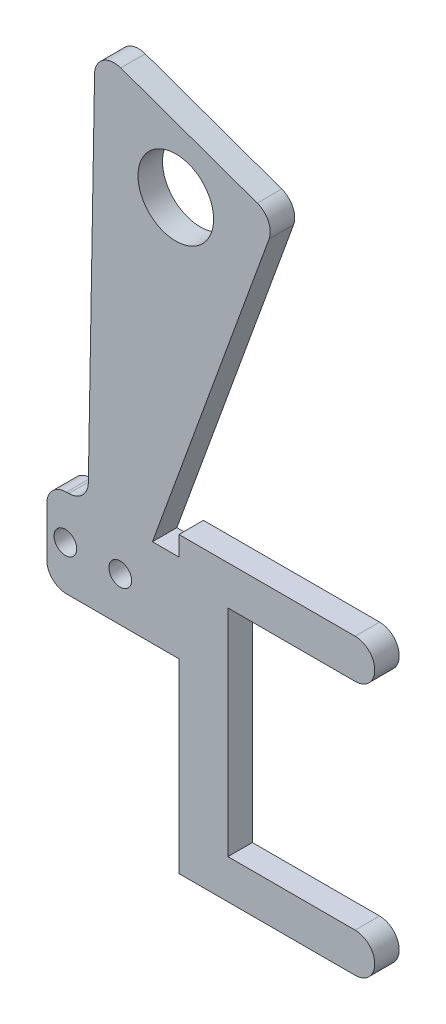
from build123d import *

# Parameters (mm, degrees)
BOSS_EXTRUDE3_DEPTH     = 3.175
SKETCH9_W               = 3.175
SKETCH9_H               = 11.43
BOSS_EXTRUDE4_DEPTH     = 3.175
F_4_CLEARANCE_HOLE1_D   = 2.9464
F_3_8_CLEARANCE_HOLE1_D = 9.8044
FILLET1_R               = 2.54
FILLET2_R               = 2.54


with BuildPart() as part:
    # Sketch6 → Boss-Extrude3 (new body)
    with BuildSketch(Plane.XY):
        with BuildLine():
            Line((36.83, 13.97), (13.97, 13.97))
            Line((13.97, 13.97), (13.97, 11.43))
            Line((13.97, 11.43), (0, 11.43))
            Line((0, 11.43), (0, 0))
            Line((0, 0), (13.97, 0))
            Line((13.97, 0), (13.97, -24.13))
            Line((13.97, -24.13), (36.83, -24.13))
            ThreePointArc((36.83, -24.13), (39.37, -21.59), (36.83, -19.05))
            Line((36.83, -19.05), (20.32, -19.05))
            Line((20.32, -19.05), (20.32, 8.89))
            Line((20.32, 8.89), (36.83, 8.89))
            ThreePointArc((36.83, 8.89), (39.37, 11.43), (36.83, 13.97))
        make_face()
    extrude(amount=BOSS_EXTRUDE3_DEPTH)

    # Sketch9 → Boss-Extrude4 (add)
    with BuildSketch(Plane.XY):
        Polygon((2.172833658, 11.43), (10.527166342, 11.43), (26.536522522, 55.415344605), (3.087001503, 63.802640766), align=None)
        with Locations((-1.5875, 5.715)):
            Rectangle(SKETCH9_W, SKETCH9_H)
    extrude(amount=BOSS_EXTRUDE4_DEPTH)

    # 4 Clearance Hole1 (through all)
    with Locations(Plane.XY.offset(3.175)):
        with Locations((-0.762, 5.715), (6.35, 5.715)):
            Hole(F_4_CLEARANCE_HOLE1_D / 2)

    # 3_8 Clearance Hole1 (through all)
    with Locations(Plane.XY.offset(3.175)):
        with Locations((13.558572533, 51.627276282)):
            Hole(F_3_8_CLEARANCE_HOLE1_D / 2)

    # Fillet1
    fillet1_edges = [part.edges().sort_by_distance(p)[0] for p in [
        (3.087001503, 63.802640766, 1.5875),
        (26.536522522, 55.415344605, 1.5875),
        (-3.175, 11.43, 1.5875),
        (-3.175, 0, 1.5875),
    ]]
    fillet(fillet1_edges, radius=FILLET1_R)

    # Fillet2
    fillet2_edges = [part.edges().sort_by_distance(p)[0] for p in [
        (2.172833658, 11.43, 1.5875),
    ]]
    fillet(fillet2_edges, radius=FILLET2_R)


solid = part.part
